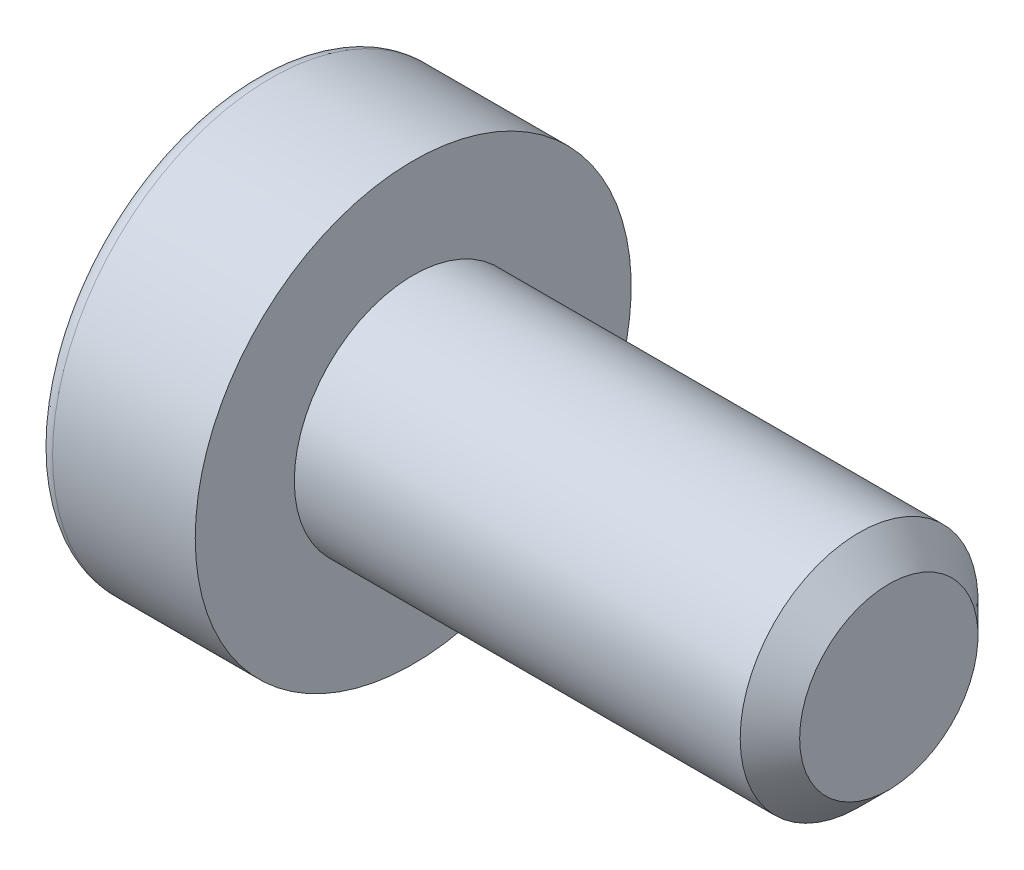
from build123d import *

# Parameters (mm, degrees)
CHANFREIN1_SIZE         = 0.375
ENL_V_MAT_EXTRU_1_DEPTH = 1
CONG_1_R                = 0.2


with BuildPart() as part:
    # Esquisse1 → R_volution1 (revolve)
    with BuildSketch(Plane.XY, mode=Mode.PRIVATE) as r_volution1_sk:
        Polygon((8, 0), (8, 1.5), (2, 1.5), (2, 2.75), (0, 2.75), (0, 0), align=None)
    revolve(r_volution1_sk.sketch.rotate(Axis((0, 0, 0), (1, 0, 0)), 90), axis=Axis((0, 0, 0), (1, 0, 0)))

    # Chanfrein1
    chanfrein1_edges = [part.edges().sort_by_distance(p)[0] for p in [
        (8, 0, -1.5),
    ]]
    chamfer(chanfrein1_edges, length=CHANFREIN1_SIZE)

    # Esquisse2 → R_volution2 (revolve)
    with BuildSketch(Plane.XY, mode=Mode.PRIVATE) as r_volution2_sk:
        Polygon((0, 0), (0, 1.25), (1, 1.25), (1.8, 0), align=None)
    revolve(r_volution2_sk.sketch.rotate(Axis((0, 0, 0), (1, 0, 0)), 90), axis=Axis((0, 0, 0), (1, 0, 0)))

    # Esquisse2_2 → Enl_vement de mati_re-R_volution1 (revolve, cut)
    with BuildSketch(Plane.XY, mode=Mode.PRIVATE) as enl_vement_de_mati_re_r_volution1_sk:
        Polygon((0, 0), (0, 1.25), (1, 1.25), (1.8, 0), align=None)
    revolve(enl_vement_de_mati_re_r_volution1_sk.sketch.rotate(Axis((0, 0, 0), (1, 0, 0)), 90), axis=Axis((0, 0, 0), (1, 0, 0)), mode=Mode.SUBTRACT)

    # Esquisse3 → Enl_v. mat.-Extru.1 (cut)
    with BuildSketch(Plane.ZY):
        Polygon((0, 1.443375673), (1.25, 0.721687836), (1.25, -0.721687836), (0, -1.443375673), (-1.25, -0.721687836), (-1.25, 0.721687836), align=None)
    extrude(amount=-ENL_V_MAT_EXTRU_1_DEPTH, mode=Mode.SUBTRACT)

    # Cong_1
    cong_1_edges = [part.edges().sort_by_distance(p)[0] for p in [
        (0, 0, -2.75),
    ]]
    fillet(cong_1_edges, radius=CONG_1_R)


solid = part.part
